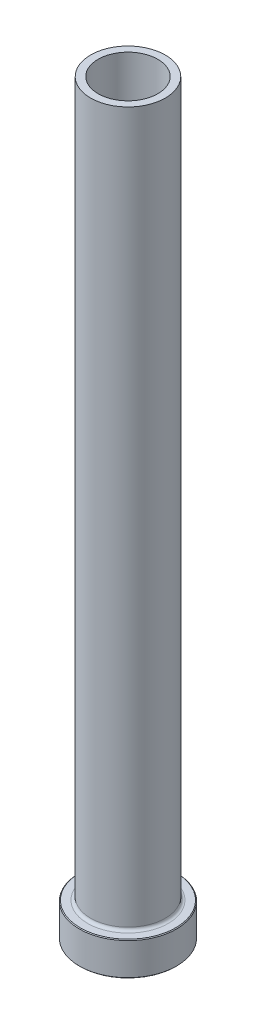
ISO-10303-21;
HEADER;
FILE_DESCRIPTION(('STEP AP214'),'2;1');
FILE_NAME('part.step','',(''),(''),'','','');
FILE_SCHEMA(('AUTOMOTIVE_DESIGN { 1 0 10303 214 1 1 1 1 }'));
ENDSEC;
DATA;
#1=APPLICATION_CONTEXT('core data for automotive mechanical design processes');
#2=APPLICATION_PROTOCOL_DEFINITION('international standard','automotive_design',2000,#1);
#3=PRODUCT_CONTEXT('',#1,'mechanical');
#4=PRODUCT('Part','Part','',(#3));
#5=PRODUCT_RELATED_PRODUCT_CATEGORY('part','',(#4));
#6=PRODUCT_DEFINITION_FORMATION('','',#4);
#7=PRODUCT_DEFINITION_CONTEXT('part definition',#1,'design');
#8=PRODUCT_DEFINITION('design','',#6,#7);
#9=PRODUCT_DEFINITION_SHAPE('','',#8);
#10=(LENGTH_UNIT() NAMED_UNIT(*) SI_UNIT(.MILLI.,.METRE.));
#11=(NAMED_UNIT(*) PLANE_ANGLE_UNIT() SI_UNIT($,.RADIAN.));
#12=(NAMED_UNIT(*) SI_UNIT($,.STERADIAN.) SOLID_ANGLE_UNIT());
#13=UNCERTAINTY_MEASURE_WITH_UNIT(LENGTH_MEASURE(1.E-05),#10,'distance_accuracy_value','');
#14=(GEOMETRIC_REPRESENTATION_CONTEXT(3) GLOBAL_UNCERTAINTY_ASSIGNED_CONTEXT((#13)) GLOBAL_UNIT_ASSIGNED_CONTEXT((#10,
#11,#12)) REPRESENTATION_CONTEXT('',''));
#15=CARTESIAN_POINT('',(0.,0.,0.));
#16=DIRECTION('',(0.,0.,1.));
#17=DIRECTION('',(1.,0.,0.));
#18=AXIS2_PLACEMENT_3D('',#15,#16,#17);
#19=CARTESIAN_POINT('',(0.,92.1876809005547,0.));
#20=DIRECTION('',(0.,1.,0.));
#21=DIRECTION('',(0.,0.,1.));
#22=AXIS2_PLACEMENT_3D('',#19,#20,#21);
#23=CYLINDRICAL_SURFACE('',#22,8.);
#24=CARTESIAN_POINT('',(0.,200.,0.));
#25=DIRECTION('',(0.,1.,0.));
#26=DIRECTION('',(0.,0.,1.));
#27=AXIS2_PLACEMENT_3D('',#24,#25,#26);
#28=CIRCLE('',#27,8.);
#29=CARTESIAN_POINT('',(0.,200.,8.));
#30=VERTEX_POINT('',#29);
#31=EDGE_CURVE('E62',#30,#30,#28,.T.);
#32=ORIENTED_EDGE('',*,*,#31,.T.);
#33=EDGE_LOOP('',(#32));
#34=FACE_BOUND('',#33,.T.);
#35=CARTESIAN_POINT('',(0.,145.,0.));
#36=DIRECTION('',(0.,1.,0.));
#37=DIRECTION('',(0.,0.,1.));
#38=AXIS2_PLACEMENT_3D('',#35,#36,#37);
#39=CIRCLE('',#38,8.);
#40=CARTESIAN_POINT('',(0.,145.,8.));
#41=VERTEX_POINT('',#40);
#42=EDGE_CURVE('E71',#41,#41,#39,.T.);
#43=ORIENTED_EDGE('',*,*,#42,.F.);
#44=EDGE_LOOP('',(#43));
#45=FACE_BOUND('',#44,.T.);
#46=ADVANCED_FACE('F30',(#34,#45),#23,.F.);
#47=CARTESIAN_POINT('',(-8.,200.,0.));
#48=DIRECTION('',(0.,1.,0.));
#49=DIRECTION('',(0.,0.,1.));
#50=AXIS2_PLACEMENT_3D('',#47,#48,#49);
#51=PLANE('',#50);
#52=CARTESIAN_POINT('',(0.,200.,0.));
#53=DIRECTION('',(0.,1.,0.));
#54=DIRECTION('',(0.,0.,1.));
#55=AXIS2_PLACEMENT_3D('',#52,#53,#54);
#56=CIRCLE('',#55,10.);
#57=CARTESIAN_POINT('',(0.,200.,10.));
#58=VERTEX_POINT('',#57);
#59=EDGE_CURVE('E65',#58,#58,#56,.T.);
#60=ORIENTED_EDGE('',*,*,#59,.T.);
#61=EDGE_LOOP('',(#60));
#62=FACE_BOUND('',#61,.T.);
#63=ORIENTED_EDGE('',*,*,#31,.F.);
#64=EDGE_LOOP('',(#63));
#65=FACE_BOUND('',#64,.T.);
#66=ADVANCED_FACE('F79',(#62,#65),#51,.T.);
#67=CARTESIAN_POINT('',(0.,92.1876809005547,0.));
#68=DIRECTION('',(0.,1.,0.));
#69=DIRECTION('',(0.,0.,1.));
#70=AXIS2_PLACEMENT_3D('',#67,#68,#69);
#71=CYLINDRICAL_SURFACE('',#70,10.);
#72=CARTESIAN_POINT('',(0.,9.8,0.));
#73=DIRECTION('',(0.,1.,0.));
#74=DIRECTION('',(0.,0.,1.));
#75=AXIS2_PLACEMENT_3D('',#72,#73,#74);
#76=CIRCLE('',#75,10.);
#77=CARTESIAN_POINT('',(0.,9.8,10.));
#78=VERTEX_POINT('',#77);
#79=EDGE_CURVE('E59',#78,#78,#76,.T.);
#80=ORIENTED_EDGE('',*,*,#79,.T.);
#81=EDGE_LOOP('',(#80));
#82=FACE_BOUND('',#81,.T.);
#83=ORIENTED_EDGE('',*,*,#59,.F.);
#84=EDGE_LOOP('',(#83));
#85=FACE_BOUND('',#84,.T.);
#86=ADVANCED_FACE('F85',(#82,#85),#71,.T.);
#87=CARTESIAN_POINT('',(-9.99999999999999,9.,0.));
#88=DIRECTION('',(0.,1.,0.));
#89=DIRECTION('',(0.,0.,1.));
#90=AXIS2_PLACEMENT_3D('',#87,#88,#89);
#91=PLANE('',#90);
#92=CARTESIAN_POINT('',(0.,9.,0.));
#93=DIRECTION('',(0.,1.,0.));
#94=DIRECTION('',(0.,0.,1.));
#95=AXIS2_PLACEMENT_3D('',#92,#93,#94);
#96=CIRCLE('',#95,12.8);
#97=CARTESIAN_POINT('',(0.,9.,12.8));
#98=VERTEX_POINT('',#97);
#99=EDGE_CURVE('E53',#98,#98,#96,.T.);
#100=ORIENTED_EDGE('',*,*,#99,.T.);
#101=EDGE_LOOP('',(#100));
#102=FACE_BOUND('',#101,.T.);
#103=CARTESIAN_POINT('',(0.,9.,0.));
#104=DIRECTION('',(0.,1.,0.));
#105=DIRECTION('',(0.,0.,1.));
#106=AXIS2_PLACEMENT_3D('',#103,#104,#105);
#107=CIRCLE('',#106,10.8);
#108=CARTESIAN_POINT('',(0.,9.,10.8));
#109=VERTEX_POINT('',#108);
#110=EDGE_CURVE('E56',#109,#109,#107,.F.);
#111=ORIENTED_EDGE('',*,*,#110,.T.);
#112=EDGE_LOOP('',(#111));
#113=FACE_BOUND('',#112,.T.);
#114=ADVANCED_FACE('F111',(#102,#113),#91,.T.);
#115=CARTESIAN_POINT('',(0.,92.1876809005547,0.));
#116=DIRECTION('',(0.,1.,0.));
#117=DIRECTION('',(0.,0.,1.));
#118=AXIS2_PLACEMENT_3D('',#115,#116,#117);
#119=CYLINDRICAL_SURFACE('',#118,13.);
#120=CARTESIAN_POINT('',(0.,8.80000000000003,0.));
#121=DIRECTION('',(0.,1.,0.));
#122=DIRECTION('',(0.,0.,1.));
#123=AXIS2_PLACEMENT_3D('',#120,#121,#122);
#124=CIRCLE('',#123,13.);
#125=CARTESIAN_POINT('',(0.,8.80000000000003,13.));
#126=VERTEX_POINT('',#125);
#127=EDGE_CURVE('E45',#126,#126,#124,.F.);
#128=ORIENTED_EDGE('',*,*,#127,.T.);
#129=EDGE_LOOP('',(#128));
#130=FACE_BOUND('',#129,.T.);
#131=CARTESIAN_POINT('',(0.,0.199999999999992,0.));
#132=DIRECTION('',(0.,-1.,0.));
#133=DIRECTION('',(0.,0.,-1.));
#134=AXIS2_PLACEMENT_3D('',#131,#132,#133);
#135=CIRCLE('',#134,13.);
#136=CARTESIAN_POINT('',(0.,0.199999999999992,-13.));
#137=VERTEX_POINT('',#136);
#138=EDGE_CURVE('E50',#137,#137,#135,.F.);
#139=ORIENTED_EDGE('',*,*,#138,.T.);
#140=EDGE_LOOP('',(#139));
#141=FACE_BOUND('',#140,.T.);
#142=ADVANCED_FACE('F108',(#130,#141),#119,.T.);
#143=CARTESIAN_POINT('',(-13.,0.,0.));
#144=DIRECTION('',(0.,-1.,0.));
#145=DIRECTION('',(0.,0.,-1.));
#146=AXIS2_PLACEMENT_3D('',#143,#144,#145);
#147=PLANE('',#146);
#148=CARTESIAN_POINT('',(0.,0.,0.));
#149=DIRECTION('',(0.,-1.,0.));
#150=DIRECTION('',(0.,0.,-1.));
#151=AXIS2_PLACEMENT_3D('',#148,#149,#150);
#152=CIRCLE('',#151,8.74999999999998);
#153=CARTESIAN_POINT('',(0.,0.,-8.74999999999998));
#154=VERTEX_POINT('',#153);
#155=EDGE_CURVE('E37',#154,#154,#152,.F.);
#156=ORIENTED_EDGE('',*,*,#155,.T.);
#157=EDGE_LOOP('',(#156));
#158=FACE_BOUND('',#157,.T.);
#159=CARTESIAN_POINT('',(0.,0.,0.));
#160=DIRECTION('',(0.,-1.,0.));
#161=DIRECTION('',(0.,0.,-1.));
#162=AXIS2_PLACEMENT_3D('',#159,#160,#161);
#163=CIRCLE('',#162,12.8);
#164=CARTESIAN_POINT('',(0.,0.,-12.8));
#165=VERTEX_POINT('',#164);
#166=EDGE_CURVE('E41',#165,#165,#163,.T.);
#167=ORIENTED_EDGE('',*,*,#166,.T.);
#168=EDGE_LOOP('',(#167));
#169=FACE_BOUND('',#168,.T.);
#170=ADVANCED_FACE('F110',(#158,#169),#147,.T.);
#171=CARTESIAN_POINT('',(0.,92.1876809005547,0.));
#172=DIRECTION('',(0.,1.,0.));
#173=DIRECTION('',(0.,0.,1.));
#174=AXIS2_PLACEMENT_3D('',#171,#172,#173);
#175=CYLINDRICAL_SURFACE('',#174,8.25);
#176=CARTESIAN_POINT('',(0.,0.499999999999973,0.));
#177=DIRECTION('',(0.,-1.,0.));
#178=DIRECTION('',(0.,0.,-1.));
#179=AXIS2_PLACEMENT_3D('',#176,#177,#178);
#180=CIRCLE('',#179,8.25);
#181=CARTESIAN_POINT('',(0.,0.499999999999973,-8.25));
#182=VERTEX_POINT('',#181);
#183=EDGE_CURVE('E10',#182,#182,#180,.T.);
#184=ORIENTED_EDGE('',*,*,#183,.T.);
#185=EDGE_LOOP('',(#184));
#186=FACE_BOUND('',#185,.T.);
#187=CARTESIAN_POINT('',(0.,133.,0.));
#188=DIRECTION('',(0.,1.,0.));
#189=DIRECTION('',(0.,0.,1.));
#190=AXIS2_PLACEMENT_3D('',#187,#188,#189);
#191=CIRCLE('',#190,8.25000000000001);
#192=CARTESIAN_POINT('',(0.,133.,8.25000000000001));
#193=VERTEX_POINT('',#192);
#194=EDGE_CURVE('E68',#193,#193,#191,.T.);
#195=ORIENTED_EDGE('',*,*,#194,.T.);
#196=EDGE_LOOP('',(#195));
#197=FACE_BOUND('',#196,.T.);
#198=ADVANCED_FACE('F118',(#186,#197),#175,.F.);
#199=CARTESIAN_POINT('',(0.,133.,0.));
#200=DIRECTION('',(0.,-1.,0.));
#201=DIRECTION('',(0.,0.,-1.));
#202=AXIS2_PLACEMENT_3D('',#199,#200,#201);
#203=CONICAL_SURFACE('',#202,8.25000000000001,0.0208303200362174);
#204=ORIENTED_EDGE('',*,*,#42,.T.);
#205=EDGE_LOOP('',(#204));
#206=FACE_BOUND('',#205,.T.);
#207=ORIENTED_EDGE('',*,*,#194,.F.);
#208=EDGE_LOOP('',(#207));
#209=FACE_BOUND('',#208,.T.);
#210=ADVANCED_FACE('F75',(#206,#209),#203,.F.);
#211=CARTESIAN_POINT('',(0.,9.8,0.));
#212=DIRECTION('',(0.,1.,0.));
#213=DIRECTION('',(0.,0.,1.));
#214=AXIS2_PLACEMENT_3D('',#211,#212,#213);
#215=TOROIDAL_SURFACE('',#214,10.8,0.8);
#216=ORIENTED_EDGE('',*,*,#110,.F.);
#217=EDGE_LOOP('',(#216));
#218=FACE_BOUND('',#217,.T.);
#219=ORIENTED_EDGE('',*,*,#79,.F.);
#220=EDGE_LOOP('',(#219));
#221=FACE_BOUND('',#220,.T.);
#222=ADVANCED_FACE('F90',(#218,#221),#215,.F.);
#223=CARTESIAN_POINT('',(0.,8.99999999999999,0.));
#224=DIRECTION('',(0.,-1.,0.));
#225=DIRECTION('',(0.,0.,-1.));
#226=AXIS2_PLACEMENT_3D('',#223,#224,#225);
#227=CONICAL_SURFACE('',#226,12.8,0.785398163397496);
#228=ORIENTED_EDGE('',*,*,#127,.F.);
#229=EDGE_LOOP('',(#228));
#230=FACE_BOUND('',#229,.T.);
#231=ORIENTED_EDGE('',*,*,#99,.F.);
#232=EDGE_LOOP('',(#231));
#233=FACE_BOUND('',#232,.T.);
#234=ADVANCED_FACE('F93',(#230,#233),#227,.T.);
#235=CARTESIAN_POINT('',(0.,0.199999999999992,0.));
#236=DIRECTION('',(0.,1.,0.));
#237=DIRECTION('',(0.,0.,1.));
#238=AXIS2_PLACEMENT_3D('',#235,#236,#237);
#239=CONICAL_SURFACE('',#238,13.,0.785398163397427);
#240=ORIENTED_EDGE('',*,*,#166,.F.);
#241=EDGE_LOOP('',(#240));
#242=FACE_BOUND('',#241,.T.);
#243=ORIENTED_EDGE('',*,*,#138,.F.);
#244=EDGE_LOOP('',(#243));
#245=FACE_BOUND('',#244,.T.);
#246=ADVANCED_FACE('F96',(#242,#245),#239,.T.);
#247=CARTESIAN_POINT('',(0.,0.,0.));
#248=DIRECTION('',(0.,-1.,0.));
#249=DIRECTION('',(0.,0.,-1.));
#250=AXIS2_PLACEMENT_3D('',#247,#248,#249);
#251=CONICAL_SURFACE('',#250,8.74999999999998,0.785398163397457);
#252=ORIENTED_EDGE('',*,*,#183,.F.);
#253=EDGE_LOOP('',(#252));
#254=FACE_BOUND('',#253,.T.);
#255=ORIENTED_EDGE('',*,*,#155,.F.);
#256=EDGE_LOOP('',(#255));
#257=FACE_BOUND('',#256,.T.);
#258=ADVANCED_FACE('F32',(#254,#257),#251,.F.);
#259=CLOSED_SHELL('',(#46,#66,#86,#114,#142,#170,#198,#210,#222,#234,#246,#258));
#260=MANIFOLD_SOLID_BREP('B2',#259);
#261=ADVANCED_BREP_SHAPE_REPRESENTATION('',(#18,#260),#14);
#262=SHAPE_DEFINITION_REPRESENTATION(#9,#261);
ENDSEC;
END-ISO-10303-21;
